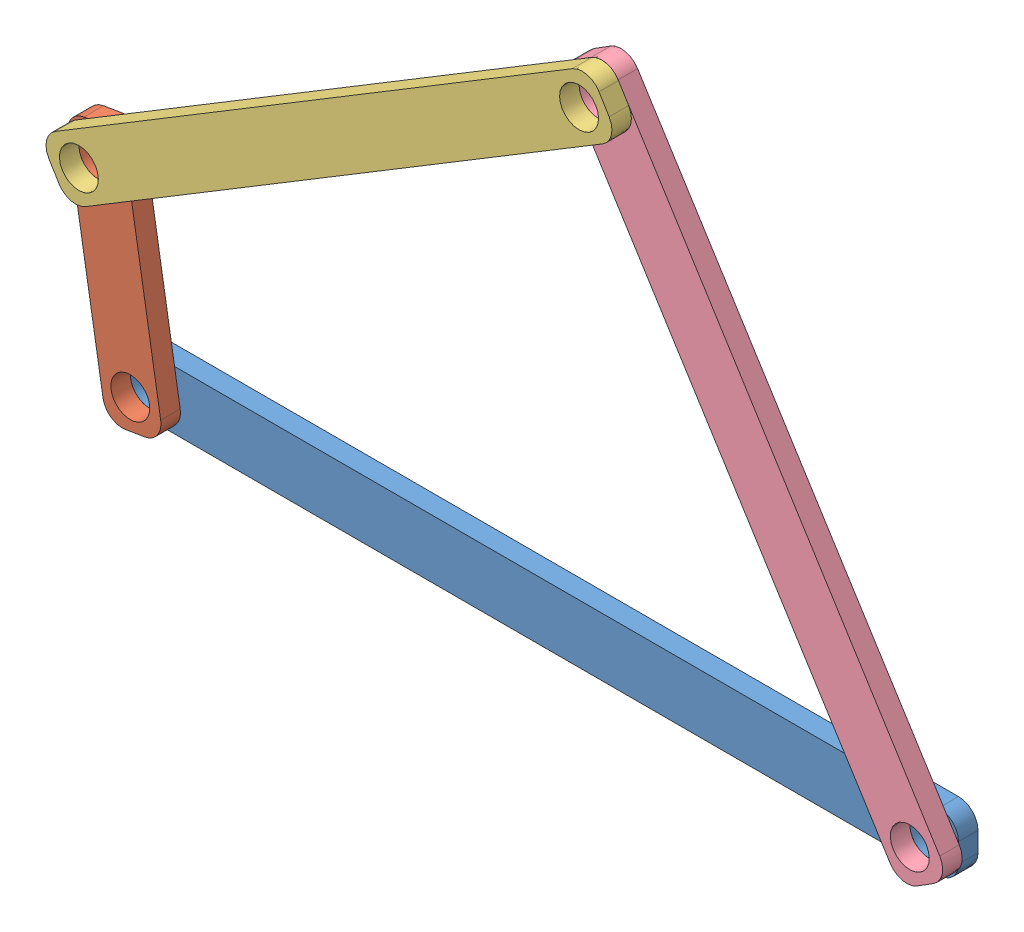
SolidWorks assembly Four_bar_mechanism_Solidworks.SLDASM, configuration Predeterminado (file format 6000). Lengths in mm.
Overall size (457.67 295.32 30).
4 component instances, 4 part files, 8 mates.
Components (placement in the parent):
- L1-1: L1.SLDPRT [Predeterminado] at origin size (430 30 10)
- L2-1: L2.SLDPRT [Predeterminado] at (-208.1924 49.3243 10) x (-0.163849 0.986485 0) z (0 0 1) size (130 30 10)
- L3-1: L3.SLDPRT [Predeterminado] at (-88.0487 176.3005 20) x (0.855574 0.51768 0) z (0 0 1) size (330 30 10)
- L4-1: L4.SLDPRT [Predeterminado] at (120.1437 126.9763 10) x (0.532375 -0.846508 0) z (0 0 1) size (330 30 10)
Mates (geometry in assembly coordinates):
- Coincidente1: coordinate: point of L1-1; point of assembly
- Concéntrica1: concentric: cylinder of L1-1 through (-200 0 5) axis (0 0 -1) radius 10; cylinder of L2-1 through (-200 0 15) axis (0 0 -1) radius 10
- Coincidente2: coincident: plane of L1-1 through (205 5 5) normal (0 0 1); plane of L2-1 through (-222.1366 102.7617 5) normal (0 0 -1)
- Concéntrica2: concentric: cylinder of L2-1 through (-216.3849 98.6485 15) axis (0 0 -1) radius 10; cylinder of L3-1 through (-216.3849 98.6485 25) axis (0 0 -1) radius 10
- Coincidente3: coincident: plane of L2-1 through (-222.1366 102.7617 15) normal (0 0 1); plane of L3-1 through (41.9769 260.8188 15) normal (0 0 -1)
- Concéntrica3: concentric: cylinder of L1-1 through (200 0 5) axis (0 0 -1) radius 10; cylinder of L4-1 through (200 0 15) axis (0 0 -1) radius 10
- Coincidente4: coincident: plane of L1-1 through (205 5 5) normal (0 0 1); plane of L4-1 through (206.8944 -1.5707 5) normal (0 0 -1)
- Concéntrica4: concentric: cylinder of L3-1 through (40.2874 253.9525 25) axis (0 0 -1) radius 10; cylinder of L4-1 through (40.2874 253.9525 15) axis (0 0 -1) radius 10
